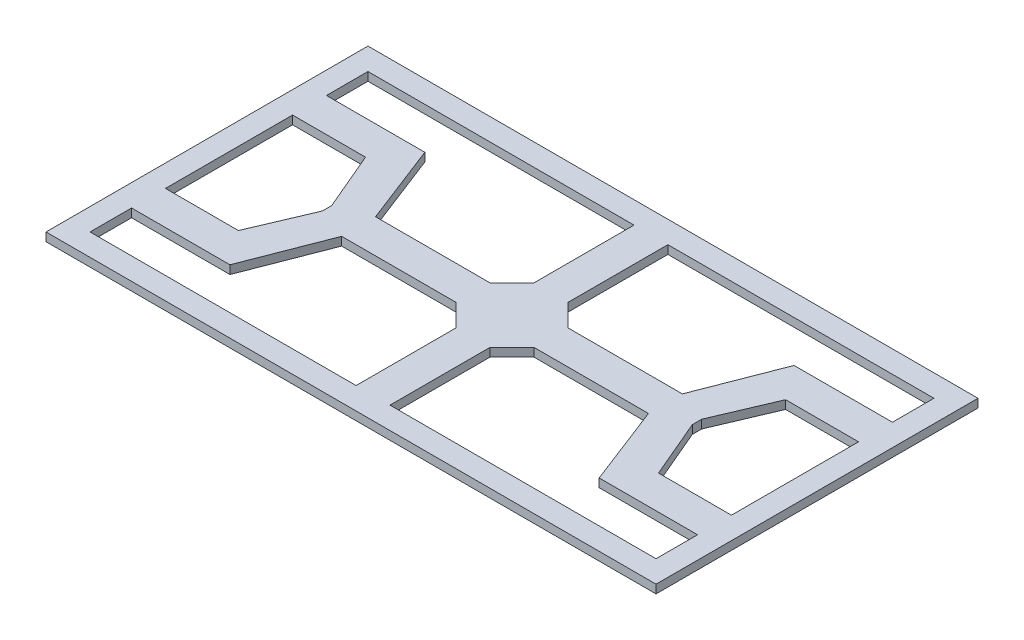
ISO-10303-21;
HEADER;
FILE_DESCRIPTION(('STEP AP214'),'2;1');
FILE_NAME('part.step','',(''),(''),'','','');
FILE_SCHEMA(('AUTOMOTIVE_DESIGN { 1 0 10303 214 1 1 1 1 }'));
ENDSEC;
DATA;
#1=APPLICATION_CONTEXT('core data for automotive mechanical design processes');
#2=APPLICATION_PROTOCOL_DEFINITION('international standard','automotive_design',2000,#1);
#3=PRODUCT_CONTEXT('',#1,'mechanical');
#4=PRODUCT('Part','Part','',(#3));
#5=PRODUCT_RELATED_PRODUCT_CATEGORY('part','',(#4));
#6=PRODUCT_DEFINITION_FORMATION('','',#4);
#7=PRODUCT_DEFINITION_CONTEXT('part definition',#1,'design');
#8=PRODUCT_DEFINITION('design','',#6,#7);
#9=PRODUCT_DEFINITION_SHAPE('','',#8);
#10=(LENGTH_UNIT() NAMED_UNIT(*) SI_UNIT(.MILLI.,.METRE.));
#11=(NAMED_UNIT(*) PLANE_ANGLE_UNIT() SI_UNIT($,.RADIAN.));
#12=(NAMED_UNIT(*) SI_UNIT($,.STERADIAN.) SOLID_ANGLE_UNIT());
#13=UNCERTAINTY_MEASURE_WITH_UNIT(LENGTH_MEASURE(1.E-05),#10,'distance_accuracy_value','');
#14=(GEOMETRIC_REPRESENTATION_CONTEXT(3) GLOBAL_UNCERTAINTY_ASSIGNED_CONTEXT((#13)) GLOBAL_UNIT_ASSIGNED_CONTEXT((#10,
#11,#12)) REPRESENTATION_CONTEXT('',''));
#15=CARTESIAN_POINT('',(0.,0.,0.));
#16=DIRECTION('',(0.,0.,1.));
#17=DIRECTION('',(1.,0.,0.));
#18=AXIS2_PLACEMENT_3D('',#15,#16,#17);
#19=CARTESIAN_POINT('',(0.,12.7,0.));
#20=DIRECTION('',(0.,-1.,0.));
#21=DIRECTION('',(0.,0.,-1.));
#22=AXIS2_PLACEMENT_3D('',#19,#20,#21);
#23=PLANE('',#22);
#24=DIRECTION('',(1.,0.,0.));
#25=VECTOR('',#24,1.);
#26=CARTESIAN_POINT('',(424.18,12.7,208.28));
#27=LINE('',#26,#25);
#28=CARTESIAN_POINT('',(25.4,12.7,208.28));
#29=VERTEX_POINT('',#28);
#30=CARTESIAN_POINT('',(424.18,12.7,208.28));
#31=VERTEX_POINT('',#30);
#32=EDGE_CURVE('E398',#29,#31,#27,.T.);
#33=ORIENTED_EDGE('',*,*,#32,.F.);
#34=DIRECTION('',(0.,0.,1.));
#35=VECTOR('',#34,1.);
#36=CARTESIAN_POINT('',(25.4,12.7,208.28));
#37=LINE('',#36,#35);
#38=CARTESIAN_POINT('',(25.4000000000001,12.7,58.1987113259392));
#39=VERTEX_POINT('',#38);
#40=EDGE_CURVE('E418',#39,#29,#37,.T.);
#41=ORIENTED_EDGE('',*,*,#40,.F.);
#42=DIRECTION('',(-0.707106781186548,0.,0.707106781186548));
#43=VECTOR('',#42,1.);
#44=CARTESIAN_POINT('',(25.4000000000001,12.7,58.1987113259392));
#45=LINE('',#44,#43);
#46=CARTESIAN_POINT('',(58.1987113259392,12.7,25.4));
#47=VERTEX_POINT('',#46);
#48=EDGE_CURVE('E414',#47,#39,#45,.T.);
#49=ORIENTED_EDGE('',*,*,#48,.F.);
#50=DIRECTION('',(-1.,0.,0.));
#51=VECTOR('',#50,1.);
#52=CARTESIAN_POINT('',(229.948625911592,12.7,25.3999999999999));
#53=LINE('',#52,#51);
#54=CARTESIAN_POINT('',(229.948625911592,12.7,25.3999999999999));
#55=VERTEX_POINT('',#54);
#56=EDGE_CURVE('E411',#55,#47,#53,.T.);
#57=ORIENTED_EDGE('',*,*,#56,.F.);
#58=DIRECTION('',(-0.36149451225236,0.,-0.932374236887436));
#59=VECTOR('',#58,1.);
#60=CARTESIAN_POINT('',(276.726315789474,12.7,146.05));
#61=LINE('',#60,#59);
#62=CARTESIAN_POINT('',(276.726315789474,12.7,146.05));
#63=VERTEX_POINT('',#62);
#64=EDGE_CURVE('E408',#63,#55,#61,.T.);
#65=ORIENTED_EDGE('',*,*,#64,.F.);
#66=DIRECTION('',(-1.,0.,0.));
#67=VECTOR('',#66,1.);
#68=CARTESIAN_POINT('',(424.18,12.7,146.05));
#69=LINE('',#68,#67);
#70=CARTESIAN_POINT('',(424.18,12.7,146.05));
#71=VERTEX_POINT('',#70);
#72=EDGE_CURVE('E405',#71,#63,#69,.T.);
#73=ORIENTED_EDGE('',*,*,#72,.F.);
#74=DIRECTION('',(0.,0.,-1.));
#75=VECTOR('',#74,1.);
#76=CARTESIAN_POINT('',(424.18,12.7,146.05));
#77=LINE('',#76,#75);
#78=EDGE_CURVE('E401',#31,#71,#77,.T.);
#79=ORIENTED_EDGE('',*,*,#78,.F.);
#80=EDGE_LOOP('',(#33,#41,#49,#57,#65,#73,#79));
#81=FACE_BOUND('',#80,.T.);
#82=DIRECTION('',(-1.,0.,0.));
#83=VECTOR('',#82,1.);
#84=CARTESIAN_POINT('',(424.18,12.7,-208.28));
#85=LINE('',#84,#83);
#86=CARTESIAN_POINT('',(424.18,12.7,-208.28));
#87=VERTEX_POINT('',#86);
#88=CARTESIAN_POINT('',(25.4,12.7,-208.28));
#89=VERTEX_POINT('',#88);
#90=EDGE_CURVE('E544',#87,#89,#85,.T.);
#91=ORIENTED_EDGE('',*,*,#90,.F.);
#92=DIRECTION('',(0.,0.,-1.));
#93=VECTOR('',#92,1.);
#94=CARTESIAN_POINT('',(424.18,12.7,-146.05));
#95=LINE('',#94,#93);
#96=CARTESIAN_POINT('',(424.18,12.7,-146.05));
#97=VERTEX_POINT('',#96);
#98=EDGE_CURVE('E564',#97,#87,#95,.T.);
#99=ORIENTED_EDGE('',*,*,#98,.F.);
#100=DIRECTION('',(1.,0.,0.));
#101=VECTOR('',#100,1.);
#102=CARTESIAN_POINT('',(424.18,12.7,-146.05));
#103=LINE('',#102,#101);
#104=CARTESIAN_POINT('',(276.726315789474,12.7,-146.05));
#105=VERTEX_POINT('',#104);
#106=EDGE_CURVE('E560',#105,#97,#103,.T.);
#107=ORIENTED_EDGE('',*,*,#106,.F.);
#108=DIRECTION('',(0.361494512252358,0.,-0.932374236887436));
#109=VECTOR('',#108,1.);
#110=CARTESIAN_POINT('',(276.726315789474,12.7,-146.05));
#111=LINE('',#110,#109);
#112=CARTESIAN_POINT('',(229.948625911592,12.7,-25.4000000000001));
#113=VERTEX_POINT('',#112);
#114=EDGE_CURVE('E557',#113,#105,#111,.T.);
#115=ORIENTED_EDGE('',*,*,#114,.F.);
#116=DIRECTION('',(1.,0.,0.));
#117=VECTOR('',#116,1.);
#118=CARTESIAN_POINT('',(229.948625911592,12.7,-25.4000000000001));
#119=LINE('',#118,#117);
#120=CARTESIAN_POINT('',(58.1987113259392,12.7,-25.4));
#121=VERTEX_POINT('',#120);
#122=EDGE_CURVE('E554',#121,#113,#119,.T.);
#123=ORIENTED_EDGE('',*,*,#122,.F.);
#124=DIRECTION('',(0.707106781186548,0.,0.707106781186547));
#125=VECTOR('',#124,1.);
#126=CARTESIAN_POINT('',(58.1987113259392,12.7,-25.4));
#127=LINE('',#126,#125);
#128=CARTESIAN_POINT('',(25.4,12.7,-58.1987113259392));
#129=VERTEX_POINT('',#128);
#130=EDGE_CURVE('E551',#129,#121,#127,.T.);
#131=ORIENTED_EDGE('',*,*,#130,.F.);
#132=DIRECTION('',(0.,0.,1.));
#133=VECTOR('',#132,1.);
#134=CARTESIAN_POINT('',(25.4,12.7,-208.28));
#135=LINE('',#134,#133);
#136=EDGE_CURVE('E547',#89,#129,#135,.T.);
#137=ORIENTED_EDGE('',*,*,#136,.F.);
#138=EDGE_LOOP('',(#91,#99,#107,#115,#123,#131,#137));
#139=FACE_BOUND('',#138,.T.);
#140=DIRECTION('',(-1.,0.,0.));
#141=VECTOR('',#140,1.);
#142=CARTESIAN_POINT('',(-424.18,12.7,-208.28));
#143=LINE('',#142,#141);
#144=CARTESIAN_POINT('',(-25.4,12.7,-208.28));
#145=VERTEX_POINT('',#144);
#146=CARTESIAN_POINT('',(-424.18,12.7,-208.28));
#147=VERTEX_POINT('',#146);
#148=EDGE_CURVE('E680',#145,#147,#143,.T.);
#149=ORIENTED_EDGE('',*,*,#148,.F.);
#150=DIRECTION('',(0.,0.,-1.));
#151=VECTOR('',#150,1.);
#152=CARTESIAN_POINT('',(-25.4,12.7,-208.28));
#153=LINE('',#152,#151);
#154=CARTESIAN_POINT('',(-25.4,12.7,-58.1987113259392));
#155=VERTEX_POINT('',#154);
#156=EDGE_CURVE('E700',#155,#145,#153,.T.);
#157=ORIENTED_EDGE('',*,*,#156,.F.);
#158=DIRECTION('',(0.707106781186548,0.,-0.707106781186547));
#159=VECTOR('',#158,1.);
#160=CARTESIAN_POINT('',(-25.4,12.7,-58.1987113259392));
#161=LINE('',#160,#159);
#162=CARTESIAN_POINT('',(-58.1987113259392,12.7,-25.4));
#163=VERTEX_POINT('',#162);
#164=EDGE_CURVE('E696',#163,#155,#161,.T.);
#165=ORIENTED_EDGE('',*,*,#164,.F.);
#166=DIRECTION('',(1.,0.,0.));
#167=VECTOR('',#166,1.);
#168=CARTESIAN_POINT('',(-229.948625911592,12.7,-25.4));
#169=LINE('',#168,#167);
#170=CARTESIAN_POINT('',(-229.948625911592,12.7,-25.4));
#171=VERTEX_POINT('',#170);
#172=EDGE_CURVE('E693',#171,#163,#169,.T.);
#173=ORIENTED_EDGE('',*,*,#172,.F.);
#174=DIRECTION('',(0.361494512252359,0.,0.932374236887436));
#175=VECTOR('',#174,1.);
#176=CARTESIAN_POINT('',(-276.726315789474,12.7,-146.05));
#177=LINE('',#176,#175);
#178=CARTESIAN_POINT('',(-276.726315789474,12.7,-146.05));
#179=VERTEX_POINT('',#178);
#180=EDGE_CURVE('E690',#179,#171,#177,.T.);
#181=ORIENTED_EDGE('',*,*,#180,.F.);
#182=DIRECTION('',(1.,0.,0.));
#183=VECTOR('',#182,1.);
#184=CARTESIAN_POINT('',(-424.18,12.7,-146.05));
#185=LINE('',#184,#183);
#186=CARTESIAN_POINT('',(-424.18,12.7,-146.05));
#187=VERTEX_POINT('',#186);
#188=EDGE_CURVE('E687',#187,#179,#185,.T.);
#189=ORIENTED_EDGE('',*,*,#188,.F.);
#190=DIRECTION('',(0.,0.,1.));
#191=VECTOR('',#190,1.);
#192=CARTESIAN_POINT('',(-424.18,12.7,-146.05));
#193=LINE('',#192,#191);
#194=EDGE_CURVE('E683',#147,#187,#193,.T.);
#195=ORIENTED_EDGE('',*,*,#194,.F.);
#196=EDGE_LOOP('',(#149,#157,#165,#173,#181,#189,#195));
#197=FACE_BOUND('',#196,.T.);
#198=DIRECTION('',(0.,0.,-1.));
#199=VECTOR('',#198,1.);
#200=CARTESIAN_POINT('',(457.2,12.7,241.3));
#201=LINE('',#200,#199);
#202=CARTESIAN_POINT('',(457.2,12.7,241.3));
#203=VERTEX_POINT('',#202);
#204=CARTESIAN_POINT('',(457.2,12.7,-241.3));
#205=VERTEX_POINT('',#204);
#206=EDGE_CURVE('E753',#203,#205,#201,.T.);
#207=ORIENTED_EDGE('',*,*,#206,.T.);
#208=DIRECTION('',(-1.,0.,0.));
#209=VECTOR('',#208,1.);
#210=CARTESIAN_POINT('',(-457.2,12.7,-241.3));
#211=LINE('',#210,#209);
#212=CARTESIAN_POINT('',(-457.2,12.7,-241.3));
#213=VERTEX_POINT('',#212);
#214=EDGE_CURVE('E757',#205,#213,#211,.T.);
#215=ORIENTED_EDGE('',*,*,#214,.T.);
#216=DIRECTION('',(0.,0.,1.));
#217=VECTOR('',#216,1.);
#218=CARTESIAN_POINT('',(-457.2,12.7,241.3));
#219=LINE('',#218,#217);
#220=CARTESIAN_POINT('',(-457.2,12.7,241.3));
#221=VERTEX_POINT('',#220);
#222=EDGE_CURVE('E761',#213,#221,#219,.T.);
#223=ORIENTED_EDGE('',*,*,#222,.T.);
#224=DIRECTION('',(1.,0.,0.));
#225=VECTOR('',#224,1.);
#226=CARTESIAN_POINT('',(-457.2,12.7,241.3));
#227=LINE('',#226,#225);
#228=EDGE_CURVE('E764',#221,#203,#227,.T.);
#229=ORIENTED_EDGE('',*,*,#228,.T.);
#230=EDGE_LOOP('',(#207,#215,#223,#229));
#231=FACE_BOUND('',#230,.T.);
#232=DIRECTION('',(0.,0.,-1.));
#233=VECTOR('',#232,1.);
#234=CARTESIAN_POINT('',(-277.313237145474,12.7,7.03607877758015));
#235=LINE('',#234,#233);
#236=CARTESIAN_POINT('',(-277.313237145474,12.7,7.03607877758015));
#237=VERTEX_POINT('',#236);
#238=CARTESIAN_POINT('',(-277.313237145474,12.7,-7.03607877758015));
#239=VERTEX_POINT('',#238);
#240=EDGE_CURVE('E617',#237,#239,#235,.T.);
#241=ORIENTED_EDGE('',*,*,#240,.F.);
#242=DIRECTION('',(0.391336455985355,0.,-0.920247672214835));
#243=VECTOR('',#242,1.);
#244=CARTESIAN_POINT('',(-314.826315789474,12.7,95.2499999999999));
#245=LINE('',#244,#243);
#246=CARTESIAN_POINT('',(-314.826315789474,12.7,95.2499999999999));
#247=VERTEX_POINT('',#246);
#248=EDGE_CURVE('E634',#247,#237,#245,.T.);
#249=ORIENTED_EDGE('',*,*,#248,.F.);
#250=DIRECTION('',(1.,0.,0.));
#251=VECTOR('',#250,1.);
#252=CARTESIAN_POINT('',(-424.18,12.7,95.2499999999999));
#253=LINE('',#252,#251);
#254=CARTESIAN_POINT('',(-424.18,12.7,95.2499999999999));
#255=VERTEX_POINT('',#254);
#256=EDGE_CURVE('E630',#255,#247,#253,.T.);
#257=ORIENTED_EDGE('',*,*,#256,.F.);
#258=DIRECTION('',(0.,0.,1.));
#259=VECTOR('',#258,1.);
#260=CARTESIAN_POINT('',(-424.18,12.7,95.2499999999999));
#261=LINE('',#260,#259);
#262=CARTESIAN_POINT('',(-424.18,12.7,-95.2499999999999));
#263=VERTEX_POINT('',#262);
#264=EDGE_CURVE('E627',#263,#255,#261,.T.);
#265=ORIENTED_EDGE('',*,*,#264,.F.);
#266=DIRECTION('',(-1.,0.,0.));
#267=VECTOR('',#266,1.);
#268=CARTESIAN_POINT('',(-424.18,12.7,-95.2499999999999));
#269=LINE('',#268,#267);
#270=CARTESIAN_POINT('',(-314.826315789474,12.7,-95.25));
#271=VERTEX_POINT('',#270);
#272=EDGE_CURVE('E624',#271,#263,#269,.T.);
#273=ORIENTED_EDGE('',*,*,#272,.F.);
#274=DIRECTION('',(-0.391336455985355,0.,-0.920247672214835));
#275=VECTOR('',#274,1.);
#276=CARTESIAN_POINT('',(-314.826315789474,12.7,-95.25));
#277=LINE('',#276,#275);
#278=EDGE_CURVE('E620',#239,#271,#277,.T.);
#279=ORIENTED_EDGE('',*,*,#278,.F.);
#280=EDGE_LOOP('',(#241,#249,#257,#265,#273,#279));
#281=FACE_BOUND('',#280,.T.);
#282=DIRECTION('',(1.,0.,0.));
#283=VECTOR('',#282,1.);
#284=CARTESIAN_POINT('',(-424.18,12.7,208.28));
#285=LINE('',#284,#283);
#286=CARTESIAN_POINT('',(-424.18,12.7,208.28));
#287=VERTEX_POINT('',#286);
#288=CARTESIAN_POINT('',(-25.4,12.7,208.28));
#289=VERTEX_POINT('',#288);
#290=EDGE_CURVE('E471',#287,#289,#285,.T.);
#291=ORIENTED_EDGE('',*,*,#290,.F.);
#292=DIRECTION('',(0.,0.,1.));
#293=VECTOR('',#292,1.);
#294=CARTESIAN_POINT('',(-424.18,12.7,146.05));
#295=LINE('',#294,#293);
#296=CARTESIAN_POINT('',(-424.18,12.7,146.05));
#297=VERTEX_POINT('',#296);
#298=EDGE_CURVE('E491',#297,#287,#295,.T.);
#299=ORIENTED_EDGE('',*,*,#298,.F.);
#300=DIRECTION('',(-1.,0.,0.));
#301=VECTOR('',#300,1.);
#302=CARTESIAN_POINT('',(-424.18,12.7,146.05));
#303=LINE('',#302,#301);
#304=CARTESIAN_POINT('',(-276.726315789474,12.7,146.05));
#305=VERTEX_POINT('',#304);
#306=EDGE_CURVE('E487',#305,#297,#303,.T.);
#307=ORIENTED_EDGE('',*,*,#306,.F.);
#308=DIRECTION('',(-0.361494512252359,0.,0.932374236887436));
#309=VECTOR('',#308,1.);
#310=CARTESIAN_POINT('',(-276.726315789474,12.7,146.05));
#311=LINE('',#310,#309);
#312=CARTESIAN_POINT('',(-229.948625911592,12.7,25.4));
#313=VERTEX_POINT('',#312);
#314=EDGE_CURVE('E484',#313,#305,#311,.T.);
#315=ORIENTED_EDGE('',*,*,#314,.F.);
#316=DIRECTION('',(-1.,0.,0.));
#317=VECTOR('',#316,1.);
#318=CARTESIAN_POINT('',(-229.948625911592,12.7,25.4));
#319=LINE('',#318,#317);
#320=CARTESIAN_POINT('',(-58.1987113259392,12.7,25.4));
#321=VERTEX_POINT('',#320);
#322=EDGE_CURVE('E481',#321,#313,#319,.T.);
#323=ORIENTED_EDGE('',*,*,#322,.F.);
#324=DIRECTION('',(-0.707106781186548,0.,-0.707106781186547));
#325=VECTOR('',#324,1.);
#326=CARTESIAN_POINT('',(-58.1987113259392,12.7,25.4));
#327=LINE('',#326,#325);
#328=CARTESIAN_POINT('',(-25.4,12.7,58.1987113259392));
#329=VERTEX_POINT('',#328);
#330=EDGE_CURVE('E478',#329,#321,#327,.T.);
#331=ORIENTED_EDGE('',*,*,#330,.F.);
#332=DIRECTION('',(0.,0.,-1.));
#333=VECTOR('',#332,1.);
#334=CARTESIAN_POINT('',(-25.4,12.7,208.28));
#335=LINE('',#334,#333);
#336=EDGE_CURVE('E474',#289,#329,#335,.T.);
#337=ORIENTED_EDGE('',*,*,#336,.F.);
#338=EDGE_LOOP('',(#291,#299,#307,#315,#323,#331,#337));
#339=FACE_BOUND('',#338,.T.);
#340=DIRECTION('',(0.391336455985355,0.,0.920247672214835));
#341=VECTOR('',#340,1.);
#342=CARTESIAN_POINT('',(314.826315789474,12.7,95.2499999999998));
#343=LINE('',#342,#341);
#344=CARTESIAN_POINT('',(277.313237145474,12.7,7.03607877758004));
#345=VERTEX_POINT('',#344);
#346=CARTESIAN_POINT('',(314.826315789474,12.7,95.2499999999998));
#347=VERTEX_POINT('',#346);
#348=EDGE_CURVE('E329',#345,#347,#343,.T.);
#349=ORIENTED_EDGE('',*,*,#348,.F.);
#350=DIRECTION('',(0.,0.,1.));
#351=VECTOR('',#350,1.);
#352=CARTESIAN_POINT('',(277.313237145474,12.7,7.03607877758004));
#353=LINE('',#352,#351);
#354=CARTESIAN_POINT('',(277.313237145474,12.7,-7.03607877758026));
#355=VERTEX_POINT('',#354);
#356=EDGE_CURVE('E364',#355,#345,#353,.T.);
#357=ORIENTED_EDGE('',*,*,#356,.F.);
#358=DIRECTION('',(-0.391336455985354,0.,0.920247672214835));
#359=VECTOR('',#358,1.);
#360=CARTESIAN_POINT('',(314.826315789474,12.7,-95.2500000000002));
#361=LINE('',#360,#359);
#362=CARTESIAN_POINT('',(314.826315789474,12.7,-95.2500000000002));
#363=VERTEX_POINT('',#362);
#364=EDGE_CURVE('E361',#363,#355,#361,.T.);
#365=ORIENTED_EDGE('',*,*,#364,.F.);
#366=DIRECTION('',(-1.,0.,0.));
#367=VECTOR('',#366,1.);
#368=CARTESIAN_POINT('',(424.18,12.7,-95.25));
#369=LINE('',#368,#367);
#370=CARTESIAN_POINT('',(424.18,12.7,-95.25));
#371=VERTEX_POINT('',#370);
#372=EDGE_CURVE('E356',#371,#363,#369,.T.);
#373=ORIENTED_EDGE('',*,*,#372,.F.);
#374=DIRECTION('',(0.,0.,-1.));
#375=VECTOR('',#374,1.);
#376=CARTESIAN_POINT('',(424.18,12.7,95.2499999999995));
#377=LINE('',#376,#375);
#378=CARTESIAN_POINT('',(424.18,12.7,95.2499999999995));
#379=VERTEX_POINT('',#378);
#380=EDGE_CURVE('E352',#379,#371,#377,.T.);
#381=ORIENTED_EDGE('',*,*,#380,.F.);
#382=DIRECTION('',(1.,0.,0.));
#383=VECTOR('',#382,1.);
#384=CARTESIAN_POINT('',(424.18,12.7,95.2499999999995));
#385=LINE('',#384,#383);
#386=EDGE_CURVE('E338',#347,#379,#385,.T.);
#387=ORIENTED_EDGE('',*,*,#386,.F.);
#388=EDGE_LOOP('',(#349,#357,#365,#373,#381,#387));
#389=FACE_BOUND('',#388,.T.);
#390=ADVANCED_FACE('F47',(#81,#139,#197,#231,#281,#339,#389),#23,.F.);
#391=CARTESIAN_POINT('',(0.,0.,0.));
#392=DIRECTION('',(0.,-1.,0.));
#393=DIRECTION('',(0.,0.,-1.));
#394=AXIS2_PLACEMENT_3D('',#391,#392,#393);
#395=PLANE('',#394);
#396=DIRECTION('',(0.,0.,-1.));
#397=VECTOR('',#396,1.);
#398=CARTESIAN_POINT('',(457.2,0.,241.3));
#399=LINE('',#398,#397);
#400=CARTESIAN_POINT('',(457.2,0.,241.3));
#401=VERTEX_POINT('',#400);
#402=CARTESIAN_POINT('',(457.2,0.,-241.3));
#403=VERTEX_POINT('',#402);
#404=EDGE_CURVE('E752',#401,#403,#399,.T.);
#405=ORIENTED_EDGE('',*,*,#404,.F.);
#406=DIRECTION('',(1.,0.,0.));
#407=VECTOR('',#406,1.);
#408=CARTESIAN_POINT('',(-457.2,0.,241.3));
#409=LINE('',#408,#407);
#410=CARTESIAN_POINT('',(-457.2,0.,241.3));
#411=VERTEX_POINT('',#410);
#412=EDGE_CURVE('E758',#411,#401,#409,.T.);
#413=ORIENTED_EDGE('',*,*,#412,.F.);
#414=DIRECTION('',(0.,0.,1.));
#415=VECTOR('',#414,1.);
#416=CARTESIAN_POINT('',(-457.2,0.,241.3));
#417=LINE('',#416,#415);
#418=CARTESIAN_POINT('',(-457.2,0.,-241.3));
#419=VERTEX_POINT('',#418);
#420=EDGE_CURVE('E774',#419,#411,#417,.T.);
#421=ORIENTED_EDGE('',*,*,#420,.F.);
#422=DIRECTION('',(-1.,0.,0.));
#423=VECTOR('',#422,1.);
#424=CARTESIAN_POINT('',(-457.2,0.,-241.3));
#425=LINE('',#424,#423);
#426=EDGE_CURVE('E771',#403,#419,#425,.T.);
#427=ORIENTED_EDGE('',*,*,#426,.F.);
#428=EDGE_LOOP('',(#405,#413,#421,#427));
#429=FACE_BOUND('',#428,.T.);
#430=DIRECTION('',(0.,0.,-1.));
#431=VECTOR('',#430,1.);
#432=CARTESIAN_POINT('',(-25.4,0.,-208.28));
#433=LINE('',#432,#431);
#434=CARTESIAN_POINT('',(-25.4,0.,-58.1987113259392));
#435=VERTEX_POINT('',#434);
#436=CARTESIAN_POINT('',(-25.4,0.,-208.28));
#437=VERTEX_POINT('',#436);
#438=EDGE_CURVE('E684',#435,#437,#433,.T.);
#439=ORIENTED_EDGE('',*,*,#438,.T.);
#440=DIRECTION('',(-1.,0.,0.));
#441=VECTOR('',#440,1.);
#442=CARTESIAN_POINT('',(-424.18,0.,-208.28));
#443=LINE('',#442,#441);
#444=CARTESIAN_POINT('',(-424.18,0.,-208.28));
#445=VERTEX_POINT('',#444);
#446=EDGE_CURVE('E679',#437,#445,#443,.T.);
#447=ORIENTED_EDGE('',*,*,#446,.T.);
#448=DIRECTION('',(0.,0.,1.));
#449=VECTOR('',#448,1.);
#450=CARTESIAN_POINT('',(-424.18,0.,-146.05));
#451=LINE('',#450,#449);
#452=CARTESIAN_POINT('',(-424.18,0.,-146.05));
#453=VERTEX_POINT('',#452);
#454=EDGE_CURVE('E707',#445,#453,#451,.T.);
#455=ORIENTED_EDGE('',*,*,#454,.T.);
#456=DIRECTION('',(1.,0.,0.));
#457=VECTOR('',#456,1.);
#458=CARTESIAN_POINT('',(-424.18,0.,-146.05));
#459=LINE('',#458,#457);
#460=CARTESIAN_POINT('',(-276.726315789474,0.,-146.05));
#461=VERTEX_POINT('',#460);
#462=EDGE_CURVE('E711',#453,#461,#459,.T.);
#463=ORIENTED_EDGE('',*,*,#462,.T.);
#464=DIRECTION('',(0.361494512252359,0.,0.932374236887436));
#465=VECTOR('',#464,1.);
#466=CARTESIAN_POINT('',(-276.726315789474,0.,-146.05));
#467=LINE('',#466,#465);
#468=CARTESIAN_POINT('',(-229.948625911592,0.,-25.4));
#469=VERTEX_POINT('',#468);
#470=EDGE_CURVE('E715',#461,#469,#467,.T.);
#471=ORIENTED_EDGE('',*,*,#470,.T.);
#472=DIRECTION('',(1.,0.,0.));
#473=VECTOR('',#472,1.);
#474=CARTESIAN_POINT('',(-229.948625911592,0.,-25.4));
#475=LINE('',#474,#473);
#476=CARTESIAN_POINT('',(-58.1987113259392,0.,-25.4));
#477=VERTEX_POINT('',#476);
#478=EDGE_CURVE('E719',#469,#477,#475,.T.);
#479=ORIENTED_EDGE('',*,*,#478,.T.);
#480=DIRECTION('',(0.707106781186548,0.,-0.707106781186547));
#481=VECTOR('',#480,1.);
#482=CARTESIAN_POINT('',(-25.4,0.,-58.1987113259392));
#483=LINE('',#482,#481);
#484=EDGE_CURVE('E723',#477,#435,#483,.T.);
#485=ORIENTED_EDGE('',*,*,#484,.T.);
#486=EDGE_LOOP('',(#439,#447,#455,#463,#471,#479,#485));
#487=FACE_BOUND('',#486,.T.);
#488=DIRECTION('',(0.391336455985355,0.,-0.920247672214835));
#489=VECTOR('',#488,1.);
#490=CARTESIAN_POINT('',(-314.826315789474,0.,95.2499999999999));
#491=LINE('',#490,#489);
#492=CARTESIAN_POINT('',(-314.826315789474,0.,95.2499999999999));
#493=VERTEX_POINT('',#492);
#494=CARTESIAN_POINT('',(-277.313237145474,0.,7.03607877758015));
#495=VERTEX_POINT('',#494);
#496=EDGE_CURVE('E621',#493,#495,#491,.T.);
#497=ORIENTED_EDGE('',*,*,#496,.T.);
#498=DIRECTION('',(0.,0.,-1.));
#499=VECTOR('',#498,1.);
#500=CARTESIAN_POINT('',(-277.313237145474,0.,7.03607877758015));
#501=LINE('',#500,#499);
#502=CARTESIAN_POINT('',(-277.313237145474,0.,-7.03607877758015));
#503=VERTEX_POINT('',#502);
#504=EDGE_CURVE('E616',#495,#503,#501,.T.);
#505=ORIENTED_EDGE('',*,*,#504,.T.);
#506=DIRECTION('',(-0.391336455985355,0.,-0.920247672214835));
#507=VECTOR('',#506,1.);
#508=CARTESIAN_POINT('',(-314.826315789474,0.,-95.25));
#509=LINE('',#508,#507);
#510=CARTESIAN_POINT('',(-314.826315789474,0.,-95.25));
#511=VERTEX_POINT('',#510);
#512=EDGE_CURVE('E641',#503,#511,#509,.T.);
#513=ORIENTED_EDGE('',*,*,#512,.T.);
#514=DIRECTION('',(-1.,0.,0.));
#515=VECTOR('',#514,1.);
#516=CARTESIAN_POINT('',(-424.18,0.,-95.2499999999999));
#517=LINE('',#516,#515);
#518=CARTESIAN_POINT('',(-424.18,0.,-95.2499999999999));
#519=VERTEX_POINT('',#518);
#520=EDGE_CURVE('E645',#511,#519,#517,.T.);
#521=ORIENTED_EDGE('',*,*,#520,.T.);
#522=DIRECTION('',(0.,0.,1.));
#523=VECTOR('',#522,1.);
#524=CARTESIAN_POINT('',(-424.18,0.,95.2499999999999));
#525=LINE('',#524,#523);
#526=CARTESIAN_POINT('',(-424.18,0.,95.2499999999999));
#527=VERTEX_POINT('',#526);
#528=EDGE_CURVE('E649',#519,#527,#525,.T.);
#529=ORIENTED_EDGE('',*,*,#528,.T.);
#530=DIRECTION('',(1.,0.,0.));
#531=VECTOR('',#530,1.);
#532=CARTESIAN_POINT('',(-424.18,0.,95.2499999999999));
#533=LINE('',#532,#531);
#534=EDGE_CURVE('E653',#527,#493,#533,.T.);
#535=ORIENTED_EDGE('',*,*,#534,.T.);
#536=EDGE_LOOP('',(#497,#505,#513,#521,#529,#535));
#537=FACE_BOUND('',#536,.T.);
#538=DIRECTION('',(0.,0.,-1.));
#539=VECTOR('',#538,1.);
#540=CARTESIAN_POINT('',(424.18,0.,-146.05));
#541=LINE('',#540,#539);
#542=CARTESIAN_POINT('',(424.18,0.,-146.05));
#543=VERTEX_POINT('',#542);
#544=CARTESIAN_POINT('',(424.18,0.,-208.28));
#545=VERTEX_POINT('',#544);
#546=EDGE_CURVE('E548',#543,#545,#541,.T.);
#547=ORIENTED_EDGE('',*,*,#546,.T.);
#548=DIRECTION('',(-1.,0.,0.));
#549=VECTOR('',#548,1.);
#550=CARTESIAN_POINT('',(424.18,0.,-208.28));
#551=LINE('',#550,#549);
#552=CARTESIAN_POINT('',(25.4,0.,-208.28));
#553=VERTEX_POINT('',#552);
#554=EDGE_CURVE('E543',#545,#553,#551,.T.);
#555=ORIENTED_EDGE('',*,*,#554,.T.);
#556=DIRECTION('',(0.,0.,1.));
#557=VECTOR('',#556,1.);
#558=CARTESIAN_POINT('',(25.4,0.,-208.28));
#559=LINE('',#558,#557);
#560=CARTESIAN_POINT('',(25.4,0.,-58.1987113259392));
#561=VERTEX_POINT('',#560);
#562=EDGE_CURVE('E571',#553,#561,#559,.T.);
#563=ORIENTED_EDGE('',*,*,#562,.T.);
#564=DIRECTION('',(0.707106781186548,0.,0.707106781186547));
#565=VECTOR('',#564,1.);
#566=CARTESIAN_POINT('',(58.1987113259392,0.,-25.4));
#567=LINE('',#566,#565);
#568=CARTESIAN_POINT('',(58.1987113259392,0.,-25.4));
#569=VERTEX_POINT('',#568);
#570=EDGE_CURVE('E575',#561,#569,#567,.T.);
#571=ORIENTED_EDGE('',*,*,#570,.T.);
#572=DIRECTION('',(1.,0.,0.));
#573=VECTOR('',#572,1.);
#574=CARTESIAN_POINT('',(229.948625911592,0.,-25.4000000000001));
#575=LINE('',#574,#573);
#576=CARTESIAN_POINT('',(229.948625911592,0.,-25.4000000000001));
#577=VERTEX_POINT('',#576);
#578=EDGE_CURVE('E579',#569,#577,#575,.T.);
#579=ORIENTED_EDGE('',*,*,#578,.T.);
#580=DIRECTION('',(0.361494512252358,0.,-0.932374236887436));
#581=VECTOR('',#580,1.);
#582=CARTESIAN_POINT('',(276.726315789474,0.,-146.05));
#583=LINE('',#582,#581);
#584=CARTESIAN_POINT('',(276.726315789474,0.,-146.05));
#585=VERTEX_POINT('',#584);
#586=EDGE_CURVE('E583',#577,#585,#583,.T.);
#587=ORIENTED_EDGE('',*,*,#586,.T.);
#588=DIRECTION('',(1.,0.,0.));
#589=VECTOR('',#588,1.);
#590=CARTESIAN_POINT('',(424.18,0.,-146.05));
#591=LINE('',#590,#589);
#592=EDGE_CURVE('E587',#585,#543,#591,.T.);
#593=ORIENTED_EDGE('',*,*,#592,.T.);
#594=EDGE_LOOP('',(#547,#555,#563,#571,#579,#587,#593));
#595=FACE_BOUND('',#594,.T.);
#596=DIRECTION('',(0.,0.,1.));
#597=VECTOR('',#596,1.);
#598=CARTESIAN_POINT('',(-424.18,0.,146.05));
#599=LINE('',#598,#597);
#600=CARTESIAN_POINT('',(-424.18,0.,146.05));
#601=VERTEX_POINT('',#600);
#602=CARTESIAN_POINT('',(-424.18,0.,208.28));
#603=VERTEX_POINT('',#602);
#604=EDGE_CURVE('E475',#601,#603,#599,.T.);
#605=ORIENTED_EDGE('',*,*,#604,.T.);
#606=DIRECTION('',(1.,0.,0.));
#607=VECTOR('',#606,1.);
#608=CARTESIAN_POINT('',(-424.18,0.,208.28));
#609=LINE('',#608,#607);
#610=CARTESIAN_POINT('',(-25.4,0.,208.28));
#611=VERTEX_POINT('',#610);
#612=EDGE_CURVE('E470',#603,#611,#609,.T.);
#613=ORIENTED_EDGE('',*,*,#612,.T.);
#614=DIRECTION('',(0.,0.,-1.));
#615=VECTOR('',#614,1.);
#616=CARTESIAN_POINT('',(-25.4,0.,208.28));
#617=LINE('',#616,#615);
#618=CARTESIAN_POINT('',(-25.4,0.,58.1987113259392));
#619=VERTEX_POINT('',#618);
#620=EDGE_CURVE('E498',#611,#619,#617,.T.);
#621=ORIENTED_EDGE('',*,*,#620,.T.);
#622=DIRECTION('',(-0.707106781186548,0.,-0.707106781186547));
#623=VECTOR('',#622,1.);
#624=CARTESIAN_POINT('',(-58.1987113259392,0.,25.4));
#625=LINE('',#624,#623);
#626=CARTESIAN_POINT('',(-58.1987113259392,0.,25.4));
#627=VERTEX_POINT('',#626);
#628=EDGE_CURVE('E502',#619,#627,#625,.T.);
#629=ORIENTED_EDGE('',*,*,#628,.T.);
#630=DIRECTION('',(-1.,0.,0.));
#631=VECTOR('',#630,1.);
#632=CARTESIAN_POINT('',(-229.948625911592,0.,25.4));
#633=LINE('',#632,#631);
#634=CARTESIAN_POINT('',(-229.948625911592,0.,25.4));
#635=VERTEX_POINT('',#634);
#636=EDGE_CURVE('E506',#627,#635,#633,.T.);
#637=ORIENTED_EDGE('',*,*,#636,.T.);
#638=DIRECTION('',(-0.361494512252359,0.,0.932374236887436));
#639=VECTOR('',#638,1.);
#640=CARTESIAN_POINT('',(-276.726315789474,0.,146.05));
#641=LINE('',#640,#639);
#642=CARTESIAN_POINT('',(-276.726315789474,0.,146.05));
#643=VERTEX_POINT('',#642);
#644=EDGE_CURVE('E510',#635,#643,#641,.T.);
#645=ORIENTED_EDGE('',*,*,#644,.T.);
#646=DIRECTION('',(-1.,0.,0.));
#647=VECTOR('',#646,1.);
#648=CARTESIAN_POINT('',(-424.18,0.,146.05));
#649=LINE('',#648,#647);
#650=EDGE_CURVE('E514',#643,#601,#649,.T.);
#651=ORIENTED_EDGE('',*,*,#650,.T.);
#652=EDGE_LOOP('',(#605,#613,#621,#629,#637,#645,#651));
#653=FACE_BOUND('',#652,.T.);
#654=DIRECTION('',(0.,0.,1.));
#655=VECTOR('',#654,1.);
#656=CARTESIAN_POINT('',(25.4,0.,208.28));
#657=LINE('',#656,#655);
#658=CARTESIAN_POINT('',(25.4000000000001,0.,58.1987113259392));
#659=VERTEX_POINT('',#658);
#660=CARTESIAN_POINT('',(25.4,0.,208.28));
#661=VERTEX_POINT('',#660);
#662=EDGE_CURVE('E402',#659,#661,#657,.T.);
#663=ORIENTED_EDGE('',*,*,#662,.T.);
#664=DIRECTION('',(1.,0.,0.));
#665=VECTOR('',#664,1.);
#666=CARTESIAN_POINT('',(424.18,0.,208.28));
#667=LINE('',#666,#665);
#668=CARTESIAN_POINT('',(424.18,0.,208.28));
#669=VERTEX_POINT('',#668);
#670=EDGE_CURVE('E347',#661,#669,#667,.T.);
#671=ORIENTED_EDGE('',*,*,#670,.T.);
#672=DIRECTION('',(0.,0.,-1.));
#673=VECTOR('',#672,1.);
#674=CARTESIAN_POINT('',(424.18,0.,146.05));
#675=LINE('',#674,#673);
#676=CARTESIAN_POINT('',(424.18,0.,146.05));
#677=VERTEX_POINT('',#676);
#678=EDGE_CURVE('E425',#669,#677,#675,.T.);
#679=ORIENTED_EDGE('',*,*,#678,.T.);
#680=DIRECTION('',(-1.,0.,0.));
#681=VECTOR('',#680,1.);
#682=CARTESIAN_POINT('',(424.18,0.,146.05));
#683=LINE('',#682,#681);
#684=CARTESIAN_POINT('',(276.726315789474,0.,146.05));
#685=VERTEX_POINT('',#684);
#686=EDGE_CURVE('E429',#677,#685,#683,.T.);
#687=ORIENTED_EDGE('',*,*,#686,.T.);
#688=DIRECTION('',(-0.36149451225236,0.,-0.932374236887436));
#689=VECTOR('',#688,1.);
#690=CARTESIAN_POINT('',(276.726315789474,0.,146.05));
#691=LINE('',#690,#689);
#692=CARTESIAN_POINT('',(229.948625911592,0.,25.3999999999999));
#693=VERTEX_POINT('',#692);
#694=EDGE_CURVE('E433',#685,#693,#691,.T.);
#695=ORIENTED_EDGE('',*,*,#694,.T.);
#696=DIRECTION('',(-1.,0.,0.));
#697=VECTOR('',#696,1.);
#698=CARTESIAN_POINT('',(229.948625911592,0.,25.3999999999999));
#699=LINE('',#698,#697);
#700=CARTESIAN_POINT('',(58.1987113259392,0.,25.4));
#701=VERTEX_POINT('',#700);
#702=EDGE_CURVE('E437',#693,#701,#699,.T.);
#703=ORIENTED_EDGE('',*,*,#702,.T.);
#704=DIRECTION('',(-0.707106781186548,0.,0.707106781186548));
#705=VECTOR('',#704,1.);
#706=CARTESIAN_POINT('',(25.4000000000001,0.,58.1987113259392));
#707=LINE('',#706,#705);
#708=EDGE_CURVE('E441',#701,#659,#707,.T.);
#709=ORIENTED_EDGE('',*,*,#708,.T.);
#710=EDGE_LOOP('',(#663,#671,#679,#687,#695,#703,#709));
#711=FACE_BOUND('',#710,.T.);
#712=DIRECTION('',(0.,0.,1.));
#713=VECTOR('',#712,1.);
#714=CARTESIAN_POINT('',(277.313237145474,0.,7.03607877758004));
#715=LINE('',#714,#713);
#716=CARTESIAN_POINT('',(277.313237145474,0.,-7.03607877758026));
#717=VERTEX_POINT('',#716);
#718=CARTESIAN_POINT('',(277.313237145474,0.,7.03607877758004));
#719=VERTEX_POINT('',#718);
#720=EDGE_CURVE('E339',#717,#719,#715,.T.);
#721=ORIENTED_EDGE('',*,*,#720,.T.);
#722=DIRECTION('',(0.391336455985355,0.,0.920247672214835));
#723=VECTOR('',#722,1.);
#724=CARTESIAN_POINT('',(314.826315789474,0.,95.2499999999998));
#725=LINE('',#724,#723);
#726=CARTESIAN_POINT('',(314.826315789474,0.,95.2499999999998));
#727=VERTEX_POINT('',#726);
#728=EDGE_CURVE('E71',#719,#727,#725,.T.);
#729=ORIENTED_EDGE('',*,*,#728,.T.);
#730=DIRECTION('',(1.,0.,0.));
#731=VECTOR('',#730,1.);
#732=CARTESIAN_POINT('',(424.18,0.,95.2499999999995));
#733=LINE('',#732,#731);
#734=CARTESIAN_POINT('',(424.18,0.,95.2499999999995));
#735=VERTEX_POINT('',#734);
#736=EDGE_CURVE('E345',#727,#735,#733,.T.);
#737=ORIENTED_EDGE('',*,*,#736,.T.);
#738=DIRECTION('',(0.,0.,-1.));
#739=VECTOR('',#738,1.);
#740=CARTESIAN_POINT('',(424.18,0.,95.2499999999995));
#741=LINE('',#740,#739);
#742=CARTESIAN_POINT('',(424.18,0.,-95.25));
#743=VERTEX_POINT('',#742);
#744=EDGE_CURVE('E371',#735,#743,#741,.T.);
#745=ORIENTED_EDGE('',*,*,#744,.T.);
#746=DIRECTION('',(-1.,0.,0.));
#747=VECTOR('',#746,1.);
#748=CARTESIAN_POINT('',(424.18,0.,-95.25));
#749=LINE('',#748,#747);
#750=CARTESIAN_POINT('',(314.826315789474,0.,-95.2500000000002));
#751=VERTEX_POINT('',#750);
#752=EDGE_CURVE('E375',#743,#751,#749,.T.);
#753=ORIENTED_EDGE('',*,*,#752,.T.);
#754=DIRECTION('',(-0.391336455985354,0.,0.920247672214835));
#755=VECTOR('',#754,1.);
#756=CARTESIAN_POINT('',(314.826315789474,0.,-95.2500000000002));
#757=LINE('',#756,#755);
#758=EDGE_CURVE('E379',#751,#717,#757,.T.);
#759=ORIENTED_EDGE('',*,*,#758,.T.);
#760=EDGE_LOOP('',(#721,#729,#737,#745,#753,#759));
#761=FACE_BOUND('',#760,.T.);
#762=ADVANCED_FACE('F797',(#429,#487,#537,#595,#653,#711,#761),#395,.T.);
#763=CARTESIAN_POINT('',(457.2,12.7,241.3));
#764=DIRECTION('',(-1.,0.,0.));
#765=DIRECTION('',(0.,0.,1.));
#766=AXIS2_PLACEMENT_3D('',#763,#764,#765);
#767=PLANE('',#766);
#768=ORIENTED_EDGE('',*,*,#404,.T.);
#769=DIRECTION('',(0.,-1.,0.));
#770=VECTOR('',#769,1.);
#771=CARTESIAN_POINT('',(457.2,12.7,-241.3));
#772=LINE('',#771,#770);
#773=EDGE_CURVE('E11',#205,#403,#772,.T.);
#774=ORIENTED_EDGE('',*,*,#773,.F.);
#775=ORIENTED_EDGE('',*,*,#206,.F.);
#776=DIRECTION('',(0.,-1.,0.));
#777=VECTOR('',#776,1.);
#778=CARTESIAN_POINT('',(457.2,12.7,241.3));
#779=LINE('',#778,#777);
#780=EDGE_CURVE('E767',#203,#401,#779,.T.);
#781=ORIENTED_EDGE('',*,*,#780,.T.);
#782=EDGE_LOOP('',(#768,#774,#775,#781));
#783=FACE_BOUND('',#782,.T.);
#784=ADVANCED_FACE('F49',(#783),#767,.F.);
#785=CARTESIAN_POINT('',(-457.2,12.7,-241.3));
#786=DIRECTION('',(0.,0.,1.));
#787=DIRECTION('',(1.,0.,0.));
#788=AXIS2_PLACEMENT_3D('',#785,#786,#787);
#789=PLANE('',#788);
#790=ORIENTED_EDGE('',*,*,#426,.T.);
#791=DIRECTION('',(0.,-1.,0.));
#792=VECTOR('',#791,1.);
#793=CARTESIAN_POINT('',(-457.2,12.7,-241.3));
#794=LINE('',#793,#792);
#795=EDGE_CURVE('E56',#213,#419,#794,.T.);
#796=ORIENTED_EDGE('',*,*,#795,.F.);
#797=ORIENTED_EDGE('',*,*,#214,.F.);
#798=ORIENTED_EDGE('',*,*,#773,.T.);
#799=EDGE_LOOP('',(#790,#796,#797,#798));
#800=FACE_BOUND('',#799,.T.);
#801=ADVANCED_FACE('F808',(#800),#789,.F.);
#802=CARTESIAN_POINT('',(-457.2,12.7,241.3));
#803=DIRECTION('',(1.,0.,0.));
#804=DIRECTION('',(0.,0.,-1.));
#805=AXIS2_PLACEMENT_3D('',#802,#803,#804);
#806=PLANE('',#805);
#807=ORIENTED_EDGE('',*,*,#420,.T.);
#808=DIRECTION('',(0.,-1.,0.));
#809=VECTOR('',#808,1.);
#810=CARTESIAN_POINT('',(-457.2,12.7,241.3));
#811=LINE('',#810,#809);
#812=EDGE_CURVE('E782',#221,#411,#811,.T.);
#813=ORIENTED_EDGE('',*,*,#812,.F.);
#814=ORIENTED_EDGE('',*,*,#222,.F.);
#815=ORIENTED_EDGE('',*,*,#795,.T.);
#816=EDGE_LOOP('',(#807,#813,#814,#815));
#817=FACE_BOUND('',#816,.T.);
#818=ADVANCED_FACE('F791',(#817),#806,.F.);
#819=CARTESIAN_POINT('',(-457.2,12.7,241.3));
#820=DIRECTION('',(0.,0.,-1.));
#821=DIRECTION('',(-1.,0.,0.));
#822=AXIS2_PLACEMENT_3D('',#819,#820,#821);
#823=PLANE('',#822);
#824=ORIENTED_EDGE('',*,*,#412,.T.);
#825=ORIENTED_EDGE('',*,*,#780,.F.);
#826=ORIENTED_EDGE('',*,*,#228,.F.);
#827=ORIENTED_EDGE('',*,*,#812,.T.);
#828=EDGE_LOOP('',(#824,#825,#826,#827));
#829=FACE_BOUND('',#828,.T.);
#830=ADVANCED_FACE('F801',(#829),#823,.F.);
#831=CARTESIAN_POINT('',(-424.18,12.7,-208.28));
#832=DIRECTION('',(0.,0.,1.));
#833=DIRECTION('',(1.,0.,0.));
#834=AXIS2_PLACEMENT_3D('',#831,#832,#833);
#835=PLANE('',#834);
#836=ORIENTED_EDGE('',*,*,#446,.F.);
#837=DIRECTION('',(0.,-1.,0.));
#838=VECTOR('',#837,1.);
#839=CARTESIAN_POINT('',(-25.4,12.7,-208.28));
#840=LINE('',#839,#838);
#841=EDGE_CURVE('E703',#145,#437,#840,.T.);
#842=ORIENTED_EDGE('',*,*,#841,.F.);
#843=ORIENTED_EDGE('',*,*,#148,.T.);
#844=DIRECTION('',(0.,-1.,0.));
#845=VECTOR('',#844,1.);
#846=CARTESIAN_POINT('',(-424.18,12.7,-208.28));
#847=LINE('',#846,#845);
#848=EDGE_CURVE('E748',#147,#445,#847,.T.);
#849=ORIENTED_EDGE('',*,*,#848,.T.);
#850=EDGE_LOOP('',(#836,#842,#843,#849));
#851=FACE_BOUND('',#850,.T.);
#852=ADVANCED_FACE('F825',(#851),#835,.T.);
#853=CARTESIAN_POINT('',(-424.18,12.7,-146.05));
#854=DIRECTION('',(1.,0.,0.));
#855=DIRECTION('',(0.,0.,-1.));
#856=AXIS2_PLACEMENT_3D('',#853,#854,#855);
#857=PLANE('',#856);
#858=ORIENTED_EDGE('',*,*,#454,.F.);
#859=ORIENTED_EDGE('',*,*,#848,.F.);
#860=ORIENTED_EDGE('',*,*,#194,.T.);
#861=DIRECTION('',(0.,-1.,0.));
#862=VECTOR('',#861,1.);
#863=CARTESIAN_POINT('',(-424.18,12.7,-146.05));
#864=LINE('',#863,#862);
#865=EDGE_CURVE('E745',#187,#453,#864,.T.);
#866=ORIENTED_EDGE('',*,*,#865,.T.);
#867=EDGE_LOOP('',(#858,#859,#860,#866));
#868=FACE_BOUND('',#867,.T.);
#869=ADVANCED_FACE('F832',(#868),#857,.T.);
#870=CARTESIAN_POINT('',(-424.18,12.7,-146.05));
#871=DIRECTION('',(0.,0.,-1.));
#872=DIRECTION('',(-1.,0.,0.));
#873=AXIS2_PLACEMENT_3D('',#870,#871,#872);
#874=PLANE('',#873);
#875=ORIENTED_EDGE('',*,*,#462,.F.);
#876=ORIENTED_EDGE('',*,*,#865,.F.);
#877=ORIENTED_EDGE('',*,*,#188,.T.);
#878=DIRECTION('',(0.,-1.,0.));
#879=VECTOR('',#878,1.);
#880=CARTESIAN_POINT('',(-276.726315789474,12.7,-146.05));
#881=LINE('',#880,#879);
#882=EDGE_CURVE('E742',#179,#461,#881,.T.);
#883=ORIENTED_EDGE('',*,*,#882,.T.);
#884=EDGE_LOOP('',(#875,#876,#877,#883));
#885=FACE_BOUND('',#884,.T.);
#886=ADVANCED_FACE('F837',(#885),#874,.T.);
#887=CARTESIAN_POINT('',(-276.726315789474,12.7,-146.05));
#888=DIRECTION('',(0.932374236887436,0.,-0.361494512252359));
#889=DIRECTION('',(-0.361494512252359,0.,-0.932374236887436));
#890=AXIS2_PLACEMENT_3D('',#887,#888,#889);
#891=PLANE('',#890);
#892=ORIENTED_EDGE('',*,*,#470,.F.);
#893=ORIENTED_EDGE('',*,*,#882,.F.);
#894=ORIENTED_EDGE('',*,*,#180,.T.);
#895=DIRECTION('',(0.,-1.,0.));
#896=VECTOR('',#895,1.);
#897=CARTESIAN_POINT('',(-229.948625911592,12.7,-25.4));
#898=LINE('',#897,#896);
#899=EDGE_CURVE('E739',#171,#469,#898,.T.);
#900=ORIENTED_EDGE('',*,*,#899,.T.);
#901=EDGE_LOOP('',(#892,#893,#894,#900));
#902=FACE_BOUND('',#901,.T.);
#903=ADVANCED_FACE('F864',(#902),#891,.T.);
#904=CARTESIAN_POINT('',(-229.948625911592,12.7,-25.4));
#905=DIRECTION('',(0.,0.,-1.));
#906=DIRECTION('',(-1.,0.,0.));
#907=AXIS2_PLACEMENT_3D('',#904,#905,#906);
#908=PLANE('',#907);
#909=ORIENTED_EDGE('',*,*,#478,.F.);
#910=ORIENTED_EDGE('',*,*,#899,.F.);
#911=ORIENTED_EDGE('',*,*,#172,.T.);
#912=DIRECTION('',(0.,-1.,0.));
#913=VECTOR('',#912,1.);
#914=CARTESIAN_POINT('',(-58.1987113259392,12.7,-25.4));
#915=LINE('',#914,#913);
#916=EDGE_CURVE('E736',#163,#477,#915,.T.);
#917=ORIENTED_EDGE('',*,*,#916,.T.);
#918=EDGE_LOOP('',(#909,#910,#911,#917));
#919=FACE_BOUND('',#918,.T.);
#920=ADVANCED_FACE('F867',(#919),#908,.T.);
#921=CARTESIAN_POINT('',(-25.4,12.7,-58.1987113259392));
#922=DIRECTION('',(-0.707106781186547,0.,-0.707106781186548));
#923=DIRECTION('',(-0.707106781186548,0.,0.707106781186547));
#924=AXIS2_PLACEMENT_3D('',#921,#922,#923);
#925=PLANE('',#924);
#926=ORIENTED_EDGE('',*,*,#484,.F.);
#927=ORIENTED_EDGE('',*,*,#916,.F.);
#928=ORIENTED_EDGE('',*,*,#164,.T.);
#929=DIRECTION('',(0.,-1.,0.));
#930=VECTOR('',#929,1.);
#931=CARTESIAN_POINT('',(-25.4,12.7,-58.1987113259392));
#932=LINE('',#931,#930);
#933=EDGE_CURVE('E733',#155,#435,#932,.T.);
#934=ORIENTED_EDGE('',*,*,#933,.T.);
#935=EDGE_LOOP('',(#926,#927,#928,#934));
#936=FACE_BOUND('',#935,.T.);
#937=ADVANCED_FACE('F851',(#936),#925,.T.);
#938=CARTESIAN_POINT('',(-25.4,12.7,-208.28));
#939=DIRECTION('',(-1.,0.,0.));
#940=DIRECTION('',(0.,0.,1.));
#941=AXIS2_PLACEMENT_3D('',#938,#939,#940);
#942=PLANE('',#941);
#943=ORIENTED_EDGE('',*,*,#438,.F.);
#944=ORIENTED_EDGE('',*,*,#933,.F.);
#945=ORIENTED_EDGE('',*,*,#156,.T.);
#946=ORIENTED_EDGE('',*,*,#841,.T.);
#947=EDGE_LOOP('',(#943,#944,#945,#946));
#948=FACE_BOUND('',#947,.T.);
#949=ADVANCED_FACE('F844',(#948),#942,.T.);
#950=CARTESIAN_POINT('',(-277.313237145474,12.7,7.03607877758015));
#951=DIRECTION('',(-1.,0.,0.));
#952=DIRECTION('',(0.,0.,1.));
#953=AXIS2_PLACEMENT_3D('',#950,#951,#952);
#954=PLANE('',#953);
#955=ORIENTED_EDGE('',*,*,#504,.F.);
#956=DIRECTION('',(0.,-1.,0.));
#957=VECTOR('',#956,1.);
#958=CARTESIAN_POINT('',(-277.313237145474,12.7,7.03607877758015));
#959=LINE('',#958,#957);
#960=EDGE_CURVE('E637',#237,#495,#959,.T.);
#961=ORIENTED_EDGE('',*,*,#960,.F.);
#962=ORIENTED_EDGE('',*,*,#240,.T.);
#963=DIRECTION('',(0.,-1.,0.));
#964=VECTOR('',#963,1.);
#965=CARTESIAN_POINT('',(-277.313237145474,12.7,-7.03607877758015));
#966=LINE('',#965,#964);
#967=EDGE_CURVE('E675',#239,#503,#966,.T.);
#968=ORIENTED_EDGE('',*,*,#967,.T.);
#969=EDGE_LOOP('',(#955,#961,#962,#968));
#970=FACE_BOUND('',#969,.T.);
#971=ADVANCED_FACE('F908',(#970),#954,.T.);
#972=CARTESIAN_POINT('',(-314.826315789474,12.7,-95.25));
#973=DIRECTION('',(-0.920247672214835,0.,0.391336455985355));
#974=DIRECTION('',(0.391336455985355,0.,0.920247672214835));
#975=AXIS2_PLACEMENT_3D('',#972,#973,#974);
#976=PLANE('',#975);
#977=ORIENTED_EDGE('',*,*,#512,.F.);
#978=ORIENTED_EDGE('',*,*,#967,.F.);
#979=ORIENTED_EDGE('',*,*,#278,.T.);
#980=DIRECTION('',(0.,-1.,0.));
#981=VECTOR('',#980,1.);
#982=CARTESIAN_POINT('',(-314.826315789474,12.7,-95.25));
#983=LINE('',#982,#981);
#984=EDGE_CURVE('E672',#271,#511,#983,.T.);
#985=ORIENTED_EDGE('',*,*,#984,.T.);
#986=EDGE_LOOP('',(#977,#978,#979,#985));
#987=FACE_BOUND('',#986,.T.);
#988=ADVANCED_FACE('F916',(#987),#976,.T.);
#989=CARTESIAN_POINT('',(-424.18,12.7,-95.2499999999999));
#990=DIRECTION('',(0.,0.,1.));
#991=DIRECTION('',(1.,0.,0.));
#992=AXIS2_PLACEMENT_3D('',#989,#990,#991);
#993=PLANE('',#992);
#994=ORIENTED_EDGE('',*,*,#520,.F.);
#995=ORIENTED_EDGE('',*,*,#984,.F.);
#996=ORIENTED_EDGE('',*,*,#272,.T.);
#997=DIRECTION('',(0.,-1.,0.));
#998=VECTOR('',#997,1.);
#999=CARTESIAN_POINT('',(-424.18,12.7,-95.2499999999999));
#1000=LINE('',#999,#998);
#1001=EDGE_CURVE('E669',#263,#519,#1000,.T.);
#1002=ORIENTED_EDGE('',*,*,#1001,.T.);
#1003=EDGE_LOOP('',(#994,#995,#996,#1002));
#1004=FACE_BOUND('',#1003,.T.);
#1005=ADVANCED_FACE('F926',(#1004),#993,.T.);
#1006=CARTESIAN_POINT('',(-424.18,12.7,95.2499999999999));
#1007=DIRECTION('',(1.,0.,0.));
#1008=DIRECTION('',(0.,0.,-1.));
#1009=AXIS2_PLACEMENT_3D('',#1006,#1007,#1008);
#1010=PLANE('',#1009);
#1011=ORIENTED_EDGE('',*,*,#528,.F.);
#1012=ORIENTED_EDGE('',*,*,#1001,.F.);
#1013=ORIENTED_EDGE('',*,*,#264,.T.);
#1014=DIRECTION('',(0.,-1.,0.));
#1015=VECTOR('',#1014,1.);
#1016=CARTESIAN_POINT('',(-424.18,12.7,95.2499999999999));
#1017=LINE('',#1016,#1015);
#1018=EDGE_CURVE('E666',#255,#527,#1017,.T.);
#1019=ORIENTED_EDGE('',*,*,#1018,.T.);
#1020=EDGE_LOOP('',(#1011,#1012,#1013,#1019));
#1021=FACE_BOUND('',#1020,.T.);
#1022=ADVANCED_FACE('F936',(#1021),#1010,.T.);
#1023=CARTESIAN_POINT('',(-424.18,12.7,95.2499999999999));
#1024=DIRECTION('',(0.,0.,-1.));
#1025=DIRECTION('',(-1.,0.,0.));
#1026=AXIS2_PLACEMENT_3D('',#1023,#1024,#1025);
#1027=PLANE('',#1026);
#1028=ORIENTED_EDGE('',*,*,#534,.F.);
#1029=ORIENTED_EDGE('',*,*,#1018,.F.);
#1030=ORIENTED_EDGE('',*,*,#256,.T.);
#1031=DIRECTION('',(0.,-1.,0.));
#1032=VECTOR('',#1031,1.);
#1033=CARTESIAN_POINT('',(-314.826315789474,12.7,95.2499999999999));
#1034=LINE('',#1033,#1032);
#1035=EDGE_CURVE('E663',#247,#493,#1034,.T.);
#1036=ORIENTED_EDGE('',*,*,#1035,.T.);
#1037=EDGE_LOOP('',(#1028,#1029,#1030,#1036));
#1038=FACE_BOUND('',#1037,.T.);
#1039=ADVANCED_FACE('F946',(#1038),#1027,.T.);
#1040=CARTESIAN_POINT('',(-314.826315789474,12.7,95.2499999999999));
#1041=DIRECTION('',(-0.920247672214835,0.,-0.391336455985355));
#1042=DIRECTION('',(-0.391336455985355,0.,0.920247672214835));
#1043=AXIS2_PLACEMENT_3D('',#1040,#1041,#1042);
#1044=PLANE('',#1043);
#1045=ORIENTED_EDGE('',*,*,#496,.F.);
#1046=ORIENTED_EDGE('',*,*,#1035,.F.);
#1047=ORIENTED_EDGE('',*,*,#248,.T.);
#1048=ORIENTED_EDGE('',*,*,#960,.T.);
#1049=EDGE_LOOP('',(#1045,#1046,#1047,#1048));
#1050=FACE_BOUND('',#1049,.T.);
#1051=ADVANCED_FACE('F956',(#1050),#1044,.T.);
#1052=CARTESIAN_POINT('',(424.18,12.7,-208.28));
#1053=DIRECTION('',(0.,0.,1.));
#1054=DIRECTION('',(1.,0.,0.));
#1055=AXIS2_PLACEMENT_3D('',#1052,#1053,#1054);
#1056=PLANE('',#1055);
#1057=ORIENTED_EDGE('',*,*,#554,.F.);
#1058=DIRECTION('',(0.,-1.,0.));
#1059=VECTOR('',#1058,1.);
#1060=CARTESIAN_POINT('',(424.18,12.7,-208.28));
#1061=LINE('',#1060,#1059);
#1062=EDGE_CURVE('E567',#87,#545,#1061,.T.);
#1063=ORIENTED_EDGE('',*,*,#1062,.F.);
#1064=ORIENTED_EDGE('',*,*,#90,.T.);
#1065=DIRECTION('',(0.,-1.,0.));
#1066=VECTOR('',#1065,1.);
#1067=CARTESIAN_POINT('',(25.4,12.7,-208.28));
#1068=LINE('',#1067,#1066);
#1069=EDGE_CURVE('E612',#89,#553,#1068,.T.);
#1070=ORIENTED_EDGE('',*,*,#1069,.T.);
#1071=EDGE_LOOP('',(#1057,#1063,#1064,#1070));
#1072=FACE_BOUND('',#1071,.T.);
#1073=ADVANCED_FACE('F966',(#1072),#1056,.T.);
#1074=CARTESIAN_POINT('',(25.4,12.7,-208.28));
#1075=DIRECTION('',(1.,0.,0.));
#1076=DIRECTION('',(0.,0.,-1.));
#1077=AXIS2_PLACEMENT_3D('',#1074,#1075,#1076);
#1078=PLANE('',#1077);
#1079=ORIENTED_EDGE('',*,*,#562,.F.);
#1080=ORIENTED_EDGE('',*,*,#1069,.F.);
#1081=ORIENTED_EDGE('',*,*,#136,.T.);
#1082=DIRECTION('',(0.,-1.,0.));
#1083=VECTOR('',#1082,1.);
#1084=CARTESIAN_POINT('',(25.4,12.7,-58.1987113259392));
#1085=LINE('',#1084,#1083);
#1086=EDGE_CURVE('E609',#129,#561,#1085,.T.);
#1087=ORIENTED_EDGE('',*,*,#1086,.T.);
#1088=EDGE_LOOP('',(#1079,#1080,#1081,#1087));
#1089=FACE_BOUND('',#1088,.T.);
#1090=ADVANCED_FACE('F976',(#1089),#1078,.T.);
#1091=CARTESIAN_POINT('',(58.1987113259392,12.7,-25.4));
#1092=DIRECTION('',(0.707106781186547,0.,-0.707106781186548));
#1093=DIRECTION('',(-0.707106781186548,0.,-0.707106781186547));
#1094=AXIS2_PLACEMENT_3D('',#1091,#1092,#1093);
#1095=PLANE('',#1094);
#1096=ORIENTED_EDGE('',*,*,#570,.F.);
#1097=ORIENTED_EDGE('',*,*,#1086,.F.);
#1098=ORIENTED_EDGE('',*,*,#130,.T.);
#1099=DIRECTION('',(0.,-1.,0.));
#1100=VECTOR('',#1099,1.);
#1101=CARTESIAN_POINT('',(58.1987113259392,12.7,-25.4));
#1102=LINE('',#1101,#1100);
#1103=EDGE_CURVE('E606',#121,#569,#1102,.T.);
#1104=ORIENTED_EDGE('',*,*,#1103,.T.);
#1105=EDGE_LOOP('',(#1096,#1097,#1098,#1104));
#1106=FACE_BOUND('',#1105,.T.);
#1107=ADVANCED_FACE('F986',(#1106),#1095,.T.);
#1108=CARTESIAN_POINT('',(229.948625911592,12.7,-25.4000000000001));
#1109=DIRECTION('',(0.,0.,-1.));
#1110=DIRECTION('',(-1.,0.,0.));
#1111=AXIS2_PLACEMENT_3D('',#1108,#1109,#1110);
#1112=PLANE('',#1111);
#1113=ORIENTED_EDGE('',*,*,#578,.F.);
#1114=ORIENTED_EDGE('',*,*,#1103,.F.);
#1115=ORIENTED_EDGE('',*,*,#122,.T.);
#1116=DIRECTION('',(0.,-1.,0.));
#1117=VECTOR('',#1116,1.);
#1118=CARTESIAN_POINT('',(229.948625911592,12.7,-25.4000000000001));
#1119=LINE('',#1118,#1117);
#1120=EDGE_CURVE('E603',#113,#577,#1119,.T.);
#1121=ORIENTED_EDGE('',*,*,#1120,.T.);
#1122=EDGE_LOOP('',(#1113,#1114,#1115,#1121));
#1123=FACE_BOUND('',#1122,.T.);
#1124=ADVANCED_FACE('F996',(#1123),#1112,.T.);
#1125=CARTESIAN_POINT('',(276.726315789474,12.7,-146.05));
#1126=DIRECTION('',(-0.932374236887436,0.,-0.361494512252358));
#1127=DIRECTION('',(-0.361494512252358,0.,0.932374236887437));
#1128=AXIS2_PLACEMENT_3D('',#1125,#1126,#1127);
#1129=PLANE('',#1128);
#1130=ORIENTED_EDGE('',*,*,#586,.F.);
#1131=ORIENTED_EDGE('',*,*,#1120,.F.);
#1132=ORIENTED_EDGE('',*,*,#114,.T.);
#1133=DIRECTION('',(0.,-1.,0.));
#1134=VECTOR('',#1133,1.);
#1135=CARTESIAN_POINT('',(276.726315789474,12.7,-146.05));
#1136=LINE('',#1135,#1134);
#1137=EDGE_CURVE('E600',#105,#585,#1136,.T.);
#1138=ORIENTED_EDGE('',*,*,#1137,.T.);
#1139=EDGE_LOOP('',(#1130,#1131,#1132,#1138));
#1140=FACE_BOUND('',#1139,.T.);
#1141=ADVANCED_FACE('F1006',(#1140),#1129,.T.);
#1142=CARTESIAN_POINT('',(424.18,12.7,-146.05));
#1143=DIRECTION('',(0.,0.,-1.));
#1144=DIRECTION('',(-1.,0.,0.));
#1145=AXIS2_PLACEMENT_3D('',#1142,#1143,#1144);
#1146=PLANE('',#1145);
#1147=ORIENTED_EDGE('',*,*,#592,.F.);
#1148=ORIENTED_EDGE('',*,*,#1137,.F.);
#1149=ORIENTED_EDGE('',*,*,#106,.T.);
#1150=DIRECTION('',(0.,-1.,0.));
#1151=VECTOR('',#1150,1.);
#1152=CARTESIAN_POINT('',(424.18,12.7,-146.05));
#1153=LINE('',#1152,#1151);
#1154=EDGE_CURVE('E597',#97,#543,#1153,.T.);
#1155=ORIENTED_EDGE('',*,*,#1154,.T.);
#1156=EDGE_LOOP('',(#1147,#1148,#1149,#1155));
#1157=FACE_BOUND('',#1156,.T.);
#1158=ADVANCED_FACE('F1016',(#1157),#1146,.T.);
#1159=CARTESIAN_POINT('',(424.18,12.7,-146.05));
#1160=DIRECTION('',(-1.,0.,0.));
#1161=DIRECTION('',(0.,0.,1.));
#1162=AXIS2_PLACEMENT_3D('',#1159,#1160,#1161);
#1163=PLANE('',#1162);
#1164=ORIENTED_EDGE('',*,*,#546,.F.);
#1165=ORIENTED_EDGE('',*,*,#1154,.F.);
#1166=ORIENTED_EDGE('',*,*,#98,.T.);
#1167=ORIENTED_EDGE('',*,*,#1062,.T.);
#1168=EDGE_LOOP('',(#1164,#1165,#1166,#1167));
#1169=FACE_BOUND('',#1168,.T.);
#1170=ADVANCED_FACE('F1026',(#1169),#1163,.T.);
#1171=CARTESIAN_POINT('',(-424.18,12.7,208.28));
#1172=DIRECTION('',(0.,0.,-1.));
#1173=DIRECTION('',(-1.,0.,0.));
#1174=AXIS2_PLACEMENT_3D('',#1171,#1172,#1173);
#1175=PLANE('',#1174);
#1176=ORIENTED_EDGE('',*,*,#612,.F.);
#1177=DIRECTION('',(0.,-1.,0.));
#1178=VECTOR('',#1177,1.);
#1179=CARTESIAN_POINT('',(-424.18,12.7,208.28));
#1180=LINE('',#1179,#1178);
#1181=EDGE_CURVE('E494',#287,#603,#1180,.T.);
#1182=ORIENTED_EDGE('',*,*,#1181,.F.);
#1183=ORIENTED_EDGE('',*,*,#290,.T.);
#1184=DIRECTION('',(0.,-1.,0.));
#1185=VECTOR('',#1184,1.);
#1186=CARTESIAN_POINT('',(-25.4,12.7,208.28));
#1187=LINE('',#1186,#1185);
#1188=EDGE_CURVE('E539',#289,#611,#1187,.T.);
#1189=ORIENTED_EDGE('',*,*,#1188,.T.);
#1190=EDGE_LOOP('',(#1176,#1182,#1183,#1189));
#1191=FACE_BOUND('',#1190,.T.);
#1192=ADVANCED_FACE('F1036',(#1191),#1175,.T.);
#1193=CARTESIAN_POINT('',(-25.4,12.7,208.28));
#1194=DIRECTION('',(-1.,0.,0.));
#1195=DIRECTION('',(0.,0.,1.));
#1196=AXIS2_PLACEMENT_3D('',#1193,#1194,#1195);
#1197=PLANE('',#1196);
#1198=ORIENTED_EDGE('',*,*,#620,.F.);
#1199=ORIENTED_EDGE('',*,*,#1188,.F.);
#1200=ORIENTED_EDGE('',*,*,#336,.T.);
#1201=DIRECTION('',(0.,-1.,0.));
#1202=VECTOR('',#1201,1.);
#1203=CARTESIAN_POINT('',(-25.4,12.7,58.1987113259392));
#1204=LINE('',#1203,#1202);
#1205=EDGE_CURVE('E536',#329,#619,#1204,.T.);
#1206=ORIENTED_EDGE('',*,*,#1205,.T.);
#1207=EDGE_LOOP('',(#1198,#1199,#1200,#1206));
#1208=FACE_BOUND('',#1207,.T.);
#1209=ADVANCED_FACE('F1046',(#1208),#1197,.T.);
#1210=CARTESIAN_POINT('',(-58.1987113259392,12.7,25.4));
#1211=DIRECTION('',(-0.707106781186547,0.,0.707106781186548));
#1212=DIRECTION('',(0.707106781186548,0.,0.707106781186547));
#1213=AXIS2_PLACEMENT_3D('',#1210,#1211,#1212);
#1214=PLANE('',#1213);
#1215=ORIENTED_EDGE('',*,*,#628,.F.);
#1216=ORIENTED_EDGE('',*,*,#1205,.F.);
#1217=ORIENTED_EDGE('',*,*,#330,.T.);
#1218=DIRECTION('',(0.,-1.,0.));
#1219=VECTOR('',#1218,1.);
#1220=CARTESIAN_POINT('',(-58.1987113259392,12.7,25.4));
#1221=LINE('',#1220,#1219);
#1222=EDGE_CURVE('E533',#321,#627,#1221,.T.);
#1223=ORIENTED_EDGE('',*,*,#1222,.T.);
#1224=EDGE_LOOP('',(#1215,#1216,#1217,#1223));
#1225=FACE_BOUND('',#1224,.T.);
#1226=ADVANCED_FACE('F1056',(#1225),#1214,.T.);
#1227=CARTESIAN_POINT('',(-229.948625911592,12.7,25.4));
#1228=DIRECTION('',(0.,0.,1.));
#1229=DIRECTION('',(1.,0.,0.));
#1230=AXIS2_PLACEMENT_3D('',#1227,#1228,#1229);
#1231=PLANE('',#1230);
#1232=ORIENTED_EDGE('',*,*,#636,.F.);
#1233=ORIENTED_EDGE('',*,*,#1222,.F.);
#1234=ORIENTED_EDGE('',*,*,#322,.T.);
#1235=DIRECTION('',(0.,-1.,0.));
#1236=VECTOR('',#1235,1.);
#1237=CARTESIAN_POINT('',(-229.948625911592,12.7,25.4));
#1238=LINE('',#1237,#1236);
#1239=EDGE_CURVE('E530',#313,#635,#1238,.T.);
#1240=ORIENTED_EDGE('',*,*,#1239,.T.);
#1241=EDGE_LOOP('',(#1232,#1233,#1234,#1240));
#1242=FACE_BOUND('',#1241,.T.);
#1243=ADVANCED_FACE('F1066',(#1242),#1231,.T.);
#1244=CARTESIAN_POINT('',(-276.726315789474,12.7,146.05));
#1245=DIRECTION('',(0.932374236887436,0.,0.361494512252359));
#1246=DIRECTION('',(0.361494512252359,0.,-0.932374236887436));
#1247=AXIS2_PLACEMENT_3D('',#1244,#1245,#1246);
#1248=PLANE('',#1247);
#1249=ORIENTED_EDGE('',*,*,#644,.F.);
#1250=ORIENTED_EDGE('',*,*,#1239,.F.);
#1251=ORIENTED_EDGE('',*,*,#314,.T.);
#1252=DIRECTION('',(0.,-1.,0.));
#1253=VECTOR('',#1252,1.);
#1254=CARTESIAN_POINT('',(-276.726315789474,12.7,146.05));
#1255=LINE('',#1254,#1253);
#1256=EDGE_CURVE('E527',#305,#643,#1255,.T.);
#1257=ORIENTED_EDGE('',*,*,#1256,.T.);
#1258=EDGE_LOOP('',(#1249,#1250,#1251,#1257));
#1259=FACE_BOUND('',#1258,.T.);
#1260=ADVANCED_FACE('F1076',(#1259),#1248,.T.);
#1261=CARTESIAN_POINT('',(-424.18,12.7,146.05));
#1262=DIRECTION('',(0.,0.,1.));
#1263=DIRECTION('',(1.,0.,0.));
#1264=AXIS2_PLACEMENT_3D('',#1261,#1262,#1263);
#1265=PLANE('',#1264);
#1266=ORIENTED_EDGE('',*,*,#650,.F.);
#1267=ORIENTED_EDGE('',*,*,#1256,.F.);
#1268=ORIENTED_EDGE('',*,*,#306,.T.);
#1269=DIRECTION('',(0.,-1.,0.));
#1270=VECTOR('',#1269,1.);
#1271=CARTESIAN_POINT('',(-424.18,12.7,146.05));
#1272=LINE('',#1271,#1270);
#1273=EDGE_CURVE('E524',#297,#601,#1272,.T.);
#1274=ORIENTED_EDGE('',*,*,#1273,.T.);
#1275=EDGE_LOOP('',(#1266,#1267,#1268,#1274));
#1276=FACE_BOUND('',#1275,.T.);
#1277=ADVANCED_FACE('F1086',(#1276),#1265,.T.);
#1278=CARTESIAN_POINT('',(-424.18,12.7,146.05));
#1279=DIRECTION('',(1.,0.,0.));
#1280=DIRECTION('',(0.,0.,-1.));
#1281=AXIS2_PLACEMENT_3D('',#1278,#1279,#1280);
#1282=PLANE('',#1281);
#1283=ORIENTED_EDGE('',*,*,#604,.F.);
#1284=ORIENTED_EDGE('',*,*,#1273,.F.);
#1285=ORIENTED_EDGE('',*,*,#298,.T.);
#1286=ORIENTED_EDGE('',*,*,#1181,.T.);
#1287=EDGE_LOOP('',(#1283,#1284,#1285,#1286));
#1288=FACE_BOUND('',#1287,.T.);
#1289=ADVANCED_FACE('F1096',(#1288),#1282,.T.);
#1290=CARTESIAN_POINT('',(424.18,12.7,208.28));
#1291=DIRECTION('',(0.,0.,-1.));
#1292=DIRECTION('',(-1.,0.,0.));
#1293=AXIS2_PLACEMENT_3D('',#1290,#1291,#1292);
#1294=PLANE('',#1293);
#1295=ORIENTED_EDGE('',*,*,#670,.F.);
#1296=DIRECTION('',(0.,-1.,0.));
#1297=VECTOR('',#1296,1.);
#1298=CARTESIAN_POINT('',(25.4,12.7,208.28));
#1299=LINE('',#1298,#1297);
#1300=EDGE_CURVE('E421',#29,#661,#1299,.T.);
#1301=ORIENTED_EDGE('',*,*,#1300,.F.);
#1302=ORIENTED_EDGE('',*,*,#32,.T.);
#1303=DIRECTION('',(0.,-1.,0.));
#1304=VECTOR('',#1303,1.);
#1305=CARTESIAN_POINT('',(424.18,12.7,208.28));
#1306=LINE('',#1305,#1304);
#1307=EDGE_CURVE('E466',#31,#669,#1306,.T.);
#1308=ORIENTED_EDGE('',*,*,#1307,.T.);
#1309=EDGE_LOOP('',(#1295,#1301,#1302,#1308));
#1310=FACE_BOUND('',#1309,.T.);
#1311=ADVANCED_FACE('F1106',(#1310),#1294,.T.);
#1312=CARTESIAN_POINT('',(424.18,12.7,146.05));
#1313=DIRECTION('',(-1.,0.,0.));
#1314=DIRECTION('',(0.,0.,1.));
#1315=AXIS2_PLACEMENT_3D('',#1312,#1313,#1314);
#1316=PLANE('',#1315);
#1317=ORIENTED_EDGE('',*,*,#678,.F.);
#1318=ORIENTED_EDGE('',*,*,#1307,.F.);
#1319=ORIENTED_EDGE('',*,*,#78,.T.);
#1320=DIRECTION('',(0.,-1.,0.));
#1321=VECTOR('',#1320,1.);
#1322=CARTESIAN_POINT('',(424.18,12.7,146.05));
#1323=LINE('',#1322,#1321);
#1324=EDGE_CURVE('E463',#71,#677,#1323,.T.);
#1325=ORIENTED_EDGE('',*,*,#1324,.T.);
#1326=EDGE_LOOP('',(#1317,#1318,#1319,#1325));
#1327=FACE_BOUND('',#1326,.T.);
#1328=ADVANCED_FACE('F1116',(#1327),#1316,.T.);
#1329=CARTESIAN_POINT('',(424.18,12.7,146.05));
#1330=DIRECTION('',(0.,0.,1.));
#1331=DIRECTION('',(1.,0.,0.));
#1332=AXIS2_PLACEMENT_3D('',#1329,#1330,#1331);
#1333=PLANE('',#1332);
#1334=ORIENTED_EDGE('',*,*,#686,.F.);
#1335=ORIENTED_EDGE('',*,*,#1324,.F.);
#1336=ORIENTED_EDGE('',*,*,#72,.T.);
#1337=DIRECTION('',(0.,-1.,0.));
#1338=VECTOR('',#1337,1.);
#1339=CARTESIAN_POINT('',(276.726315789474,12.7,146.05));
#1340=LINE('',#1339,#1338);
#1341=EDGE_CURVE('E460',#63,#685,#1340,.T.);
#1342=ORIENTED_EDGE('',*,*,#1341,.T.);
#1343=EDGE_LOOP('',(#1334,#1335,#1336,#1342));
#1344=FACE_BOUND('',#1343,.T.);
#1345=ADVANCED_FACE('F1126',(#1344),#1333,.T.);
#1346=CARTESIAN_POINT('',(276.726315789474,12.7,146.05));
#1347=DIRECTION('',(-0.932374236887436,0.,0.36149451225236));
#1348=DIRECTION('',(0.36149451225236,0.,0.932374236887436));
#1349=AXIS2_PLACEMENT_3D('',#1346,#1347,#1348);
#1350=PLANE('',#1349);
#1351=ORIENTED_EDGE('',*,*,#694,.F.);
#1352=ORIENTED_EDGE('',*,*,#1341,.F.);
#1353=ORIENTED_EDGE('',*,*,#64,.T.);
#1354=DIRECTION('',(0.,-1.,0.));
#1355=VECTOR('',#1354,1.);
#1356=CARTESIAN_POINT('',(229.948625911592,12.7,25.3999999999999));
#1357=LINE('',#1356,#1355);
#1358=EDGE_CURVE('E457',#55,#693,#1357,.T.);
#1359=ORIENTED_EDGE('',*,*,#1358,.T.);
#1360=EDGE_LOOP('',(#1351,#1352,#1353,#1359));
#1361=FACE_BOUND('',#1360,.T.);
#1362=ADVANCED_FACE('F1136',(#1361),#1350,.T.);
#1363=CARTESIAN_POINT('',(229.948625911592,12.7,25.3999999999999));
#1364=DIRECTION('',(0.,0.,1.));
#1365=DIRECTION('',(1.,0.,0.));
#1366=AXIS2_PLACEMENT_3D('',#1363,#1364,#1365);
#1367=PLANE('',#1366);
#1368=ORIENTED_EDGE('',*,*,#702,.F.);
#1369=ORIENTED_EDGE('',*,*,#1358,.F.);
#1370=ORIENTED_EDGE('',*,*,#56,.T.);
#1371=DIRECTION('',(0.,-1.,0.));
#1372=VECTOR('',#1371,1.);
#1373=CARTESIAN_POINT('',(58.1987113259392,12.7,25.4));
#1374=LINE('',#1373,#1372);
#1375=EDGE_CURVE('E454',#47,#701,#1374,.T.);
#1376=ORIENTED_EDGE('',*,*,#1375,.T.);
#1377=EDGE_LOOP('',(#1368,#1369,#1370,#1376));
#1378=FACE_BOUND('',#1377,.T.);
#1379=ADVANCED_FACE('F1146',(#1378),#1367,.T.);
#1380=CARTESIAN_POINT('',(25.4000000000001,12.7,58.1987113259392));
#1381=DIRECTION('',(0.707106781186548,0.,0.707106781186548));
#1382=DIRECTION('',(0.707106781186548,0.,-0.707106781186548));
#1383=AXIS2_PLACEMENT_3D('',#1380,#1381,#1382);
#1384=PLANE('',#1383);
#1385=ORIENTED_EDGE('',*,*,#708,.F.);
#1386=ORIENTED_EDGE('',*,*,#1375,.F.);
#1387=ORIENTED_EDGE('',*,*,#48,.T.);
#1388=DIRECTION('',(0.,-1.,0.));
#1389=VECTOR('',#1388,1.);
#1390=CARTESIAN_POINT('',(25.4000000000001,12.7,58.1987113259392));
#1391=LINE('',#1390,#1389);
#1392=EDGE_CURVE('E451',#39,#659,#1391,.T.);
#1393=ORIENTED_EDGE('',*,*,#1392,.T.);
#1394=EDGE_LOOP('',(#1385,#1386,#1387,#1393));
#1395=FACE_BOUND('',#1394,.T.);
#1396=ADVANCED_FACE('F1156',(#1395),#1384,.T.);
#1397=CARTESIAN_POINT('',(25.4,12.7,208.28));
#1398=DIRECTION('',(1.,0.,0.));
#1399=DIRECTION('',(0.,0.,-1.));
#1400=AXIS2_PLACEMENT_3D('',#1397,#1398,#1399);
#1401=PLANE('',#1400);
#1402=ORIENTED_EDGE('',*,*,#662,.F.);
#1403=ORIENTED_EDGE('',*,*,#1392,.F.);
#1404=ORIENTED_EDGE('',*,*,#40,.T.);
#1405=ORIENTED_EDGE('',*,*,#1300,.T.);
#1406=EDGE_LOOP('',(#1402,#1403,#1404,#1405));
#1407=FACE_BOUND('',#1406,.T.);
#1408=ADVANCED_FACE('F1166',(#1407),#1401,.T.);
#1409=CARTESIAN_POINT('',(314.826315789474,12.7,95.2499999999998));
#1410=DIRECTION('',(0.920247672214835,0.,-0.391336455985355));
#1411=DIRECTION('',(-0.391336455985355,0.,-0.920247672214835));
#1412=AXIS2_PLACEMENT_3D('',#1409,#1410,#1411);
#1413=PLANE('',#1412);
#1414=ORIENTED_EDGE('',*,*,#728,.F.);
#1415=DIRECTION('',(0.,-1.,0.));
#1416=VECTOR('',#1415,1.);
#1417=CARTESIAN_POINT('',(277.313237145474,12.7,7.03607877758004));
#1418=LINE('',#1417,#1416);
#1419=EDGE_CURVE('E333',#345,#719,#1418,.T.);
#1420=ORIENTED_EDGE('',*,*,#1419,.F.);
#1421=ORIENTED_EDGE('',*,*,#348,.T.);
#1422=DIRECTION('',(0.,-1.,0.));
#1423=VECTOR('',#1422,1.);
#1424=CARTESIAN_POINT('',(314.826315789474,12.7,95.2499999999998));
#1425=LINE('',#1424,#1423);
#1426=EDGE_CURVE('E332',#347,#727,#1425,.T.);
#1427=ORIENTED_EDGE('',*,*,#1426,.T.);
#1428=EDGE_LOOP('',(#1414,#1420,#1421,#1427));
#1429=FACE_BOUND('',#1428,.T.);
#1430=ADVANCED_FACE('F331',(#1429),#1413,.T.);
#1431=CARTESIAN_POINT('',(424.18,12.7,95.2499999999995));
#1432=DIRECTION('',(0.,0.,-1.));
#1433=DIRECTION('',(-1.,0.,0.));
#1434=AXIS2_PLACEMENT_3D('',#1431,#1432,#1433);
#1435=PLANE('',#1434);
#1436=ORIENTED_EDGE('',*,*,#736,.F.);
#1437=ORIENTED_EDGE('',*,*,#1426,.F.);
#1438=ORIENTED_EDGE('',*,*,#386,.T.);
#1439=DIRECTION('',(0.,-1.,0.));
#1440=VECTOR('',#1439,1.);
#1441=CARTESIAN_POINT('',(424.18,12.7,95.2499999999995));
#1442=LINE('',#1441,#1440);
#1443=EDGE_CURVE('E348',#379,#735,#1442,.T.);
#1444=ORIENTED_EDGE('',*,*,#1443,.T.);
#1445=EDGE_LOOP('',(#1436,#1437,#1438,#1444));
#1446=FACE_BOUND('',#1445,.T.);
#1447=ADVANCED_FACE('F342',(#1446),#1435,.T.);
#1448=CARTESIAN_POINT('',(424.18,12.7,95.2499999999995));
#1449=DIRECTION('',(-1.,0.,0.));
#1450=DIRECTION('',(0.,0.,1.));
#1451=AXIS2_PLACEMENT_3D('',#1448,#1449,#1450);
#1452=PLANE('',#1451);
#1453=ORIENTED_EDGE('',*,*,#744,.F.);
#1454=ORIENTED_EDGE('',*,*,#1443,.F.);
#1455=ORIENTED_EDGE('',*,*,#380,.T.);
#1456=DIRECTION('',(0.,-1.,0.));
#1457=VECTOR('',#1456,1.);
#1458=CARTESIAN_POINT('',(424.18,12.7,-95.25));
#1459=LINE('',#1458,#1457);
#1460=EDGE_CURVE('E393',#371,#743,#1459,.T.);
#1461=ORIENTED_EDGE('',*,*,#1460,.T.);
#1462=EDGE_LOOP('',(#1453,#1454,#1455,#1461));
#1463=FACE_BOUND('',#1462,.T.);
#1464=ADVANCED_FACE('F1193',(#1463),#1452,.T.);
#1465=CARTESIAN_POINT('',(424.18,12.7,-95.25));
#1466=DIRECTION('',(0.,0.,1.));
#1467=DIRECTION('',(1.,0.,0.));
#1468=AXIS2_PLACEMENT_3D('',#1465,#1466,#1467);
#1469=PLANE('',#1468);
#1470=ORIENTED_EDGE('',*,*,#752,.F.);
#1471=ORIENTED_EDGE('',*,*,#1460,.F.);
#1472=ORIENTED_EDGE('',*,*,#372,.T.);
#1473=DIRECTION('',(0.,-1.,0.));
#1474=VECTOR('',#1473,1.);
#1475=CARTESIAN_POINT('',(314.826315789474,12.7,-95.2500000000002));
#1476=LINE('',#1475,#1474);
#1477=EDGE_CURVE('E390',#363,#751,#1476,.T.);
#1478=ORIENTED_EDGE('',*,*,#1477,.T.);
#1479=EDGE_LOOP('',(#1470,#1471,#1472,#1478));
#1480=FACE_BOUND('',#1479,.T.);
#1481=ADVANCED_FACE('F1202',(#1480),#1469,.T.);
#1482=CARTESIAN_POINT('',(314.826315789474,12.7,-95.2500000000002));
#1483=DIRECTION('',(0.920247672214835,0.,0.391336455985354));
#1484=DIRECTION('',(0.391336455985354,0.,-0.920247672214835));
#1485=AXIS2_PLACEMENT_3D('',#1482,#1483,#1484);
#1486=PLANE('',#1485);
#1487=ORIENTED_EDGE('',*,*,#758,.F.);
#1488=ORIENTED_EDGE('',*,*,#1477,.F.);
#1489=ORIENTED_EDGE('',*,*,#364,.T.);
#1490=DIRECTION('',(0.,-1.,0.));
#1491=VECTOR('',#1490,1.);
#1492=CARTESIAN_POINT('',(277.313237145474,12.7,-7.03607877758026));
#1493=LINE('',#1492,#1491);
#1494=EDGE_CURVE('E63',#355,#717,#1493,.T.);
#1495=ORIENTED_EDGE('',*,*,#1494,.T.);
#1496=EDGE_LOOP('',(#1487,#1488,#1489,#1495));
#1497=FACE_BOUND('',#1496,.T.);
#1498=ADVANCED_FACE('F1212',(#1497),#1486,.T.);
#1499=CARTESIAN_POINT('',(277.313237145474,12.7,7.03607877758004));
#1500=DIRECTION('',(1.,0.,0.));
#1501=DIRECTION('',(0.,0.,-1.));
#1502=AXIS2_PLACEMENT_3D('',#1499,#1500,#1501);
#1503=PLANE('',#1502);
#1504=ORIENTED_EDGE('',*,*,#720,.F.);
#1505=ORIENTED_EDGE('',*,*,#1494,.F.);
#1506=ORIENTED_EDGE('',*,*,#356,.T.);
#1507=ORIENTED_EDGE('',*,*,#1419,.T.);
#1508=EDGE_LOOP('',(#1504,#1505,#1506,#1507));
#1509=FACE_BOUND('',#1508,.T.);
#1510=ADVANCED_FACE('F1222',(#1509),#1503,.T.);
#1511=CLOSED_SHELL('',(#390,#762,#784,#801,#818,#830,#852,#869,#886,#903,#920,#937,#949,#971,
#988,#1005,#1022,#1039,#1051,#1073,#1090,#1107,#1124,#1141,#1158,#1170,#1192,#1209,#1226,#1243,
#1260,#1277,#1289,#1311,#1328,#1345,#1362,#1379,#1396,#1408,#1430,#1447,#1464,#1481,#1498,#1510));
#1512=MANIFOLD_SOLID_BREP('B2',#1511);
#1513=ADVANCED_BREP_SHAPE_REPRESENTATION('',(#18,#1512),#14);
#1514=SHAPE_DEFINITION_REPRESENTATION(#9,#1513);
ENDSEC;
END-ISO-10303-21;
